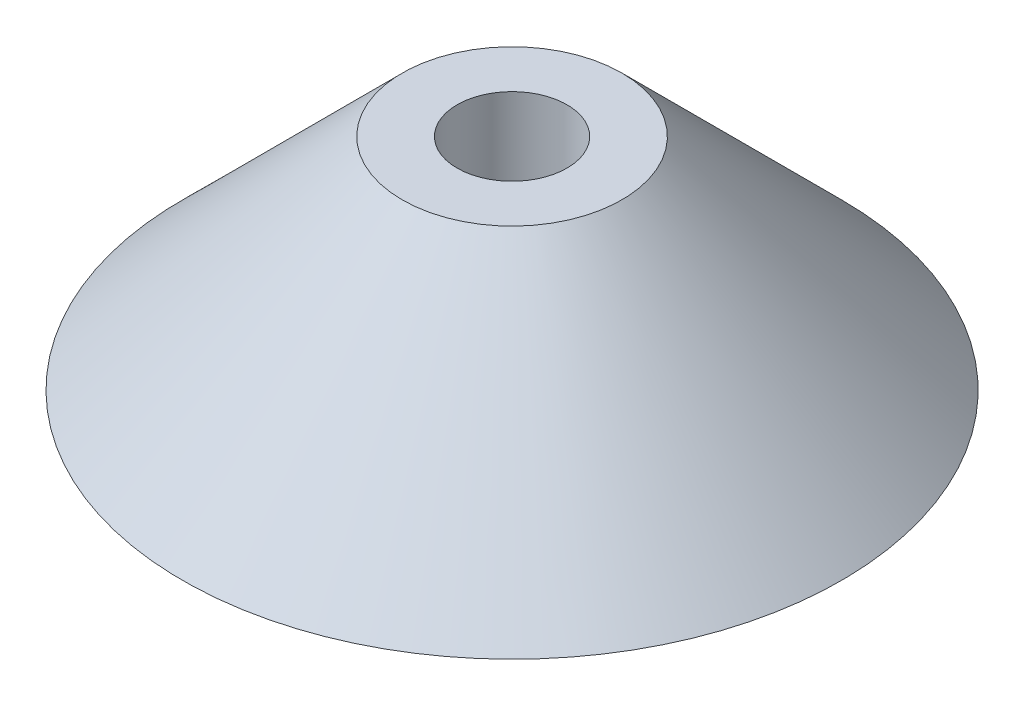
from build123d import *

# Parameters (mm, degrees)
F_10_0_10_DURCHMESSER_BOHRUNG1_D = 10


with BuildPart() as part:
    # Skizze1 → Rotation1 (revolve)
    with BuildSketch(Plane.XY, mode=Mode.PRIVATE) as rotation1_sk:
        Polygon((0, 0), (-30, 0), (-10, 20), (0, 20), align=None)
    revolve(rotation1_sk.sketch.rotate(Axis((0, 0, 0), (0, -1, 0)), 90), axis=Axis((0, 0, 0), (0, -1, 0)))

    # 10.0 _10_ Durchmesser Bohrung1 (through all)
    with Locations(Plane(origin=(0, 20, 0), x_dir=(1, 0, 0), z_dir=(0, 1, 0))):
        with Locations((0, 0)):
            Hole(F_10_0_10_DURCHMESSER_BOHRUNG1_D / 2)


solid = part.part
